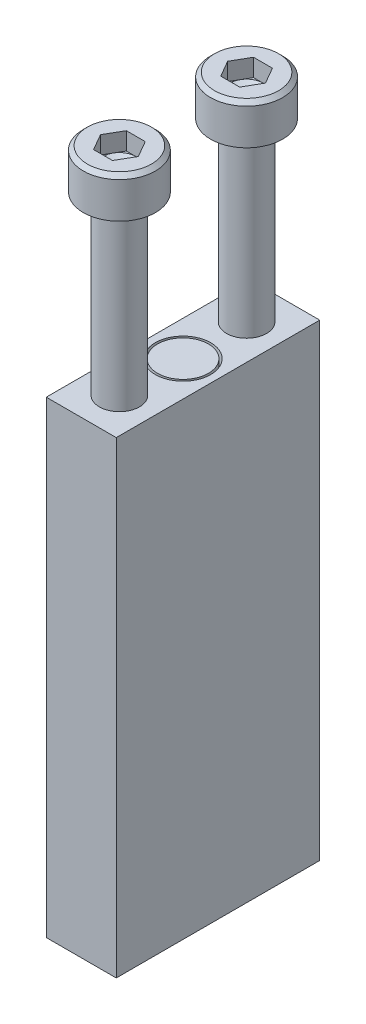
ISO-10303-21;
HEADER;
FILE_DESCRIPTION(('STEP AP214'),'2;1');
FILE_NAME('part.step','',(''),(''),'','','');
FILE_SCHEMA(('AUTOMOTIVE_DESIGN { 1 0 10303 214 1 1 1 1 }'));
ENDSEC;
DATA;
#1=APPLICATION_CONTEXT('core data for automotive mechanical design processes');
#2=APPLICATION_PROTOCOL_DEFINITION('international standard','automotive_design',2000,#1);
#3=PRODUCT_CONTEXT('',#1,'mechanical');
#4=PRODUCT('Part','Part','',(#3));
#5=PRODUCT_RELATED_PRODUCT_CATEGORY('part','',(#4));
#6=PRODUCT_DEFINITION_FORMATION('','',#4);
#7=PRODUCT_DEFINITION_CONTEXT('part definition',#1,'design');
#8=PRODUCT_DEFINITION('design','',#6,#7);
#9=PRODUCT_DEFINITION_SHAPE('','',#8);
#10=(LENGTH_UNIT() NAMED_UNIT(*) SI_UNIT(.MILLI.,.METRE.));
#11=(NAMED_UNIT(*) PLANE_ANGLE_UNIT() SI_UNIT($,.RADIAN.));
#12=(NAMED_UNIT(*) SI_UNIT($,.STERADIAN.) SOLID_ANGLE_UNIT());
#13=UNCERTAINTY_MEASURE_WITH_UNIT(LENGTH_MEASURE(1.E-05),#10,'distance_accuracy_value','');
#14=(GEOMETRIC_REPRESENTATION_CONTEXT(3) GLOBAL_UNCERTAINTY_ASSIGNED_CONTEXT((#13)) GLOBAL_UNIT_ASSIGNED_CONTEXT((#10,
#11,#12)) REPRESENTATION_CONTEXT('',''));
#15=CARTESIAN_POINT('',(0.,0.,0.));
#16=DIRECTION('',(0.,0.,1.));
#17=DIRECTION('',(1.,0.,0.));
#18=AXIS2_PLACEMENT_3D('',#15,#16,#17);
#19=CARTESIAN_POINT('',(-2.1844,0.,0.));
#20=DIRECTION('',(0.,-1.,0.));
#21=DIRECTION('',(1.,0.,0.));
#22=AXIS2_PLACEMENT_3D('',#19,#20,#21);
#23=CYLINDRICAL_SURFACE('',#22,1.5875);
#24=CARTESIAN_POINT('',(-2.1844,0.,0.));
#25=DIRECTION('',(0.,-1.,0.));
#26=DIRECTION('',(1.,0.,0.));
#27=AXIS2_PLACEMENT_3D('',#24,#25,#26);
#28=CIRCLE('',#27,1.5875);
#29=CARTESIAN_POINT('',(-0.5969,0.,0.));
#30=VERTEX_POINT('',#29);
#31=EDGE_CURVE('P0_E9',#30,#30,#28,.T.);
#32=ORIENTED_EDGE('',*,*,#31,.T.);
#33=EDGE_LOOP('',(#32));
#34=FACE_BOUND('',#33,.T.);
#35=CARTESIAN_POINT('',(-2.1844,-19.05,0.));
#36=DIRECTION('',(0.,-1.,0.));
#37=DIRECTION('',(1.,0.,0.));
#38=AXIS2_PLACEMENT_3D('',#35,#36,#37);
#39=CIRCLE('',#38,1.5875);
#40=CARTESIAN_POINT('',(-0.5969,-19.05,0.));
#41=VERTEX_POINT('',#40);
#42=EDGE_CURVE('P0_E19',#41,#41,#39,.T.);
#43=ORIENTED_EDGE('',*,*,#42,.F.);
#44=EDGE_LOOP('',(#43));
#45=FACE_BOUND('',#44,.T.);
#46=ADVANCED_FACE('P0_F13',(#34,#45),#23,.T.);
#47=CARTESIAN_POINT('',(-2.1844,0.,0.));
#48=DIRECTION('',(0.,-1.,0.));
#49=DIRECTION('',(1.,0.,0.));
#50=AXIS2_PLACEMENT_3D('',#47,#48,#49);
#51=PLANE('',#50);
#52=ORIENTED_EDGE('',*,*,#31,.F.);
#53=EDGE_LOOP('',(#52));
#54=FACE_BOUND('',#53,.T.);
#55=ADVANCED_FACE('P0_F28',(#54),#51,.F.);
#56=CARTESIAN_POINT('',(-2.1844,-19.05,0.));
#57=DIRECTION('',(0.,-1.,0.));
#58=DIRECTION('',(1.,0.,0.));
#59=AXIS2_PLACEMENT_3D('',#56,#57,#58);
#60=PLANE('',#59);
#61=ORIENTED_EDGE('',*,*,#42,.T.);
#62=EDGE_LOOP('',(#61));
#63=FACE_BOUND('',#62,.T.);
#64=ADVANCED_FACE('P0_F25',(#63),#60,.T.);
#65=CLOSED_SHELL('',(#46,#55,#64));
#66=MANIFOLD_SOLID_BREP('P0_B1',#65);
#67=CARTESIAN_POINT('',(-4.3688,0.,-6.35));
#68=DIRECTION('',(0.,0.,1.));
#69=DIRECTION('',(0.,1.,0.));
#70=AXIS2_PLACEMENT_3D('',#67,#68,#69);
#71=PLANE('',#70);
#72=DIRECTION('',(0.,-1.,0.));
#73=VECTOR('',#72,1.);
#74=CARTESIAN_POINT('',(0.,0.,-6.35));
#75=LINE('',#74,#73);
#76=CARTESIAN_POINT('',(0.,0.,-6.35));
#77=VERTEX_POINT('',#76);
#78=CARTESIAN_POINT('',(0.,-29.21,-6.35));
#79=VERTEX_POINT('',#78);
#80=EDGE_CURVE('P1_E362',#77,#79,#75,.T.);
#81=ORIENTED_EDGE('',*,*,#80,.T.);
#82=DIRECTION('',(1.,0.,0.));
#83=VECTOR('',#82,1.);
#84=CARTESIAN_POINT('',(-4.3688,-29.21,-6.35));
#85=LINE('',#84,#83);
#86=CARTESIAN_POINT('',(-4.3688,-29.21,-6.35));
#87=VERTEX_POINT('',#86);
#88=EDGE_CURVE('P1_E337',#87,#79,#85,.T.);
#89=ORIENTED_EDGE('',*,*,#88,.F.);
#90=DIRECTION('',(0.,-1.,0.));
#91=VECTOR('',#90,1.);
#92=CARTESIAN_POINT('',(-4.3688,0.,-6.35));
#93=LINE('',#92,#91);
#94=CARTESIAN_POINT('',(-4.3688,0.,-6.35));
#95=VERTEX_POINT('',#94);
#96=EDGE_CURVE('P1_E354',#95,#87,#93,.T.);
#97=ORIENTED_EDGE('',*,*,#96,.F.);
#98=DIRECTION('',(1.,0.,0.));
#99=VECTOR('',#98,1.);
#100=CARTESIAN_POINT('',(-4.3688,0.,-6.35));
#101=LINE('',#100,#99);
#102=EDGE_CURVE('P1_E345',#95,#77,#101,.T.);
#103=ORIENTED_EDGE('',*,*,#102,.T.);
#104=EDGE_LOOP('',(#81,#89,#97,#103));
#105=FACE_BOUND('',#104,.T.);
#106=ADVANCED_FACE('P1_F15',(#105),#71,.F.);
#107=CARTESIAN_POINT('',(-4.3688,-29.21,-6.35));
#108=DIRECTION('',(0.,1.,0.));
#109=DIRECTION('',(-1.,0.,0.));
#110=AXIS2_PLACEMENT_3D('',#107,#108,#109);
#111=PLANE('',#110);
#112=DIRECTION('',(0.,0.,1.));
#113=VECTOR('',#112,1.);
#114=CARTESIAN_POINT('',(0.,-29.21,-6.35));
#115=LINE('',#114,#113);
#116=CARTESIAN_POINT('',(0.,-29.21,6.35));
#117=VERTEX_POINT('',#116);
#118=EDGE_CURVE('P1_E33',#79,#117,#115,.T.);
#119=ORIENTED_EDGE('',*,*,#118,.T.);
#120=DIRECTION('',(1.,0.,0.));
#121=VECTOR('',#120,1.);
#122=CARTESIAN_POINT('',(-4.3688,-29.21,6.35));
#123=LINE('',#122,#121);
#124=CARTESIAN_POINT('',(-4.3688,-29.21,6.35));
#125=VERTEX_POINT('',#124);
#126=EDGE_CURVE('P1_E339',#125,#117,#123,.T.);
#127=ORIENTED_EDGE('',*,*,#126,.F.);
#128=DIRECTION('',(0.,0.,1.));
#129=VECTOR('',#128,1.);
#130=CARTESIAN_POINT('',(-4.3688,-29.21,-6.35));
#131=LINE('',#130,#129);
#132=EDGE_CURVE('P1_E352',#87,#125,#131,.T.);
#133=ORIENTED_EDGE('',*,*,#132,.F.);
#134=ORIENTED_EDGE('',*,*,#88,.T.);
#135=EDGE_LOOP('',(#119,#127,#133,#134));
#136=FACE_BOUND('',#135,.T.);
#137=ADVANCED_FACE('P1_F494',(#136),#111,.F.);
#138=CARTESIAN_POINT('',(-4.3688,0.,6.35));
#139=DIRECTION('',(0.,0.,-1.));
#140=DIRECTION('',(0.,-1.,0.));
#141=AXIS2_PLACEMENT_3D('',#138,#139,#140);
#142=PLANE('',#141);
#143=DIRECTION('',(0.,1.,0.));
#144=VECTOR('',#143,1.);
#145=CARTESIAN_POINT('',(0.,0.,6.35));
#146=LINE('',#145,#144);
#147=CARTESIAN_POINT('',(0.,0.,6.35));
#148=VERTEX_POINT('',#147);
#149=EDGE_CURVE('P1_E359',#117,#148,#146,.T.);
#150=ORIENTED_EDGE('',*,*,#149,.T.);
#151=DIRECTION('',(1.,0.,0.));
#152=VECTOR('',#151,1.);
#153=CARTESIAN_POINT('',(-4.3688,0.,6.35));
#154=LINE('',#153,#152);
#155=CARTESIAN_POINT('',(-4.3688,0.,6.35));
#156=VERTEX_POINT('',#155);
#157=EDGE_CURVE('P1_E342',#156,#148,#154,.T.);
#158=ORIENTED_EDGE('',*,*,#157,.F.);
#159=DIRECTION('',(0.,1.,0.));
#160=VECTOR('',#159,1.);
#161=CARTESIAN_POINT('',(-4.3688,0.,6.35));
#162=LINE('',#161,#160);
#163=EDGE_CURVE('P1_E350',#125,#156,#162,.T.);
#164=ORIENTED_EDGE('',*,*,#163,.F.);
#165=ORIENTED_EDGE('',*,*,#126,.T.);
#166=EDGE_LOOP('',(#150,#158,#164,#165));
#167=FACE_BOUND('',#166,.T.);
#168=ADVANCED_FACE('P1_F373',(#167),#142,.F.);
#169=CARTESIAN_POINT('',(-4.3688,0.,-6.35));
#170=DIRECTION('',(0.,-1.,0.));
#171=DIRECTION('',(1.,0.,0.));
#172=AXIS2_PLACEMENT_3D('',#169,#170,#171);
#173=PLANE('',#172);
#174=CARTESIAN_POINT('',(-2.1844,0.,-3.96875));
#175=DIRECTION('',(0.,-1.,0.));
#176=DIRECTION('',(0.,0.,-1.));
#177=AXIS2_PLACEMENT_3D('',#174,#175,#176);
#178=CIRCLE('',#177,1.25);
#179=CARTESIAN_POINT('',(-2.1844,0.,-5.21875));
#180=VERTEX_POINT('',#179);
#181=EDGE_CURVE('P1_E919',#180,#180,#178,.F.);
#182=ORIENTED_EDGE('',*,*,#181,.F.);
#183=EDGE_LOOP('',(#182));
#184=FACE_BOUND('',#183,.T.);
#185=CARTESIAN_POINT('',(-2.1844,0.,3.96875));
#186=DIRECTION('',(0.,-1.,0.));
#187=DIRECTION('',(0.,0.,-1.));
#188=AXIS2_PLACEMENT_3D('',#185,#186,#187);
#189=CIRCLE('',#188,1.25);
#190=CARTESIAN_POINT('',(-2.1844,0.,2.71875));
#191=VERTEX_POINT('',#190);
#192=EDGE_CURVE('P1_E257',#191,#191,#189,.F.);
#193=ORIENTED_EDGE('',*,*,#192,.F.);
#194=EDGE_LOOP('',(#193));
#195=FACE_BOUND('',#194,.T.);
#196=CARTESIAN_POINT('',(-2.1844,0.,0.));
#197=DIRECTION('',(0.,1.,0.));
#198=DIRECTION('',(-1.,0.,0.));
#199=AXIS2_PLACEMENT_3D('',#196,#197,#198);
#200=CIRCLE('',#199,1.7272);
#201=CARTESIAN_POINT('',(-3.9116,0.,0.));
#202=VERTEX_POINT('',#201);
#203=EDGE_CURVE('P1_E23',#202,#202,#200,.T.);
#204=ORIENTED_EDGE('',*,*,#203,.F.);
#205=EDGE_LOOP('',(#204));
#206=FACE_BOUND('',#205,.T.);
#207=DIRECTION('',(0.,0.,-1.));
#208=VECTOR('',#207,1.);
#209=CARTESIAN_POINT('',(0.,0.,-6.35));
#210=LINE('',#209,#208);
#211=EDGE_CURVE('P1_E357',#148,#77,#210,.T.);
#212=ORIENTED_EDGE('',*,*,#211,.T.);
#213=ORIENTED_EDGE('',*,*,#102,.F.);
#214=DIRECTION('',(0.,0.,-1.));
#215=VECTOR('',#214,1.);
#216=CARTESIAN_POINT('',(-4.3688,0.,-6.35));
#217=LINE('',#216,#215);
#218=EDGE_CURVE('P1_E348',#156,#95,#217,.T.);
#219=ORIENTED_EDGE('',*,*,#218,.F.);
#220=ORIENTED_EDGE('',*,*,#157,.T.);
#221=EDGE_LOOP('',(#212,#213,#219,#220));
#222=FACE_BOUND('',#221,.T.);
#223=ADVANCED_FACE('P1_F369',(#184,#195,#206,#222),#173,.F.);
#224=CARTESIAN_POINT('',(-4.3688,-29.21,-6.35));
#225=DIRECTION('',(-1.,0.,0.));
#226=DIRECTION('',(0.,0.,1.));
#227=AXIS2_PLACEMENT_3D('',#224,#225,#226);
#228=PLANE('',#227);
#229=ORIENTED_EDGE('',*,*,#96,.T.);
#230=ORIENTED_EDGE('',*,*,#132,.T.);
#231=ORIENTED_EDGE('',*,*,#163,.T.);
#232=ORIENTED_EDGE('',*,*,#218,.T.);
#233=EDGE_LOOP('',(#229,#230,#231,#232));
#234=FACE_BOUND('',#233,.T.);
#235=ADVANCED_FACE('P1_F372',(#234),#228,.T.);
#236=CARTESIAN_POINT('',(0.,-29.21,-6.35));
#237=DIRECTION('',(-1.,0.,0.));
#238=DIRECTION('',(0.,0.,1.));
#239=AXIS2_PLACEMENT_3D('',#236,#237,#238);
#240=PLANE('',#239);
#241=ORIENTED_EDGE('',*,*,#80,.F.);
#242=ORIENTED_EDGE('',*,*,#211,.F.);
#243=ORIENTED_EDGE('',*,*,#149,.F.);
#244=ORIENTED_EDGE('',*,*,#118,.F.);
#245=EDGE_LOOP('',(#241,#242,#243,#244));
#246=FACE_BOUND('',#245,.T.);
#247=ADVANCED_FACE('P1_F383',(#246),#240,.F.);
#248=CARTESIAN_POINT('',(-2.1844,0.,0.));
#249=DIRECTION('',(0.,1.,0.));
#250=DIRECTION('',(-1.,0.,0.));
#251=AXIS2_PLACEMENT_3D('',#248,#249,#250);
#252=CYLINDRICAL_SURFACE('',#251,1.7272);
#253=CARTESIAN_POINT('',(-2.1844,-26.67,0.));
#254=DIRECTION('',(0.,1.,0.));
#255=DIRECTION('',(-1.,0.,0.));
#256=AXIS2_PLACEMENT_3D('',#253,#254,#255);
#257=CIRCLE('',#256,1.7272);
#258=CARTESIAN_POINT('',(-3.9116,-26.67,0.));
#259=VERTEX_POINT('',#258);
#260=EDGE_CURVE('P1_E10',#259,#259,#257,.T.);
#261=ORIENTED_EDGE('',*,*,#260,.F.);
#262=EDGE_LOOP('',(#261));
#263=FACE_BOUND('',#262,.T.);
#264=ORIENTED_EDGE('',*,*,#203,.T.);
#265=EDGE_LOOP('',(#264));
#266=FACE_BOUND('',#265,.T.);
#267=ADVANCED_FACE('P1_F367',(#263,#266),#252,.F.);
#268=CARTESIAN_POINT('',(-2.1844,-26.67,0.));
#269=DIRECTION('',(0.,1.,0.));
#270=DIRECTION('',(-1.,0.,0.));
#271=AXIS2_PLACEMENT_3D('',#268,#269,#270);
#272=CONICAL_SURFACE('',#271,1.7272,1.02974425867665);
#273=CARTESIAN_POINT('',(-2.1844,-27.7078064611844,0.));
#274=VERTEX_POINT('',#273);
#275=VERTEX_LOOP('',#274);
#276=FACE_BOUND('',#275,.T.);
#277=ORIENTED_EDGE('',*,*,#260,.T.);
#278=EDGE_LOOP('',(#277));
#279=FACE_BOUND('',#278,.T.);
#280=ADVANCED_FACE('P1_F17',(#276,#279),#272,.F.);
#281=CARTESIAN_POINT('',(-2.1844,12.4,3.96875));
#282=DIRECTION('',(0.,1.,0.));
#283=DIRECTION('',(0.,0.,1.));
#284=AXIS2_PLACEMENT_3D('',#281,#282,#283);
#285=CONICAL_SURFACE('',#284,1.0225,1.04719755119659);
#286=CARTESIAN_POINT('',(-2.1844,11.8096593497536,3.96875));
#287=VERTEX_POINT('',#286);
#288=VERTEX_LOOP('',#287);
#289=FACE_BOUND('',#288,.T.);
#290=CARTESIAN_POINT('',(-2.1844,12.4,3.96875));
#291=DIRECTION('',(0.,1.,0.));
#292=DIRECTION('',(0.,0.,1.));
#293=AXIS2_PLACEMENT_3D('',#290,#291,#292);
#294=CIRCLE('',#293,1.0225);
#295=CARTESIAN_POINT('',(-2.1844,12.4,4.99125));
#296=VERTEX_POINT('',#295);
#297=CARTESIAN_POINT('',(-1.29888902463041,12.4,4.48));
#298=VERTEX_POINT('',#297);
#299=EDGE_CURVE('P1_E275',#296,#298,#294,.T.);
#300=ORIENTED_EDGE('',*,*,#299,.T.);
#301=CARTESIAN_POINT('',(-1.29888902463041,12.4,3.4575));
#302=VERTEX_POINT('',#301);
#303=EDGE_CURVE('P1_E278',#298,#302,#294,.T.);
#304=ORIENTED_EDGE('',*,*,#303,.T.);
#305=CARTESIAN_POINT('',(-2.1844,12.4,2.94625));
#306=VERTEX_POINT('',#305);
#307=EDGE_CURVE('P1_E967',#302,#306,#294,.T.);
#308=ORIENTED_EDGE('',*,*,#307,.T.);
#309=CARTESIAN_POINT('',(-3.06991097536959,12.4,3.4575));
#310=VERTEX_POINT('',#309);
#311=EDGE_CURVE('P1_E980',#306,#310,#294,.T.);
#312=ORIENTED_EDGE('',*,*,#311,.T.);
#313=CARTESIAN_POINT('',(-3.06991097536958,12.4,4.48));
#314=VERTEX_POINT('',#313);
#315=EDGE_CURVE('P1_E979',#310,#314,#294,.T.);
#316=ORIENTED_EDGE('',*,*,#315,.T.);
#317=EDGE_CURVE('P1_E279',#314,#296,#294,.T.);
#318=ORIENTED_EDGE('',*,*,#317,.T.);
#319=EDGE_LOOP('',(#300,#304,#308,#312,#316,#318));
#320=FACE_BOUND('',#319,.T.);
#321=ADVANCED_FACE('P1_F456',(#289,#320),#285,.F.);
#322=CARTESIAN_POINT('',(-1.59405934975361,12.4,4.99125));
#323=DIRECTION('',(0.,1.,0.));
#324=DIRECTION('',(0.,0.,1.));
#325=AXIS2_PLACEMENT_3D('',#322,#323,#324);
#326=PLANE('',#325);
#327=ORIENTED_EDGE('',*,*,#307,.F.);
#328=DIRECTION('',(-0.5,0.,-0.866025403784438));
#329=VECTOR('',#328,1.);
#330=CARTESIAN_POINT('',(-1.00371869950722,12.4,3.96875));
#331=LINE('',#330,#329);
#332=CARTESIAN_POINT('',(-1.59405934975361,12.4,2.94625));
#333=VERTEX_POINT('',#332);
#334=EDGE_CURVE('P1_E301',#302,#333,#331,.T.);
#335=ORIENTED_EDGE('',*,*,#334,.T.);
#336=DIRECTION('',(-1.,0.,0.));
#337=VECTOR('',#336,1.);
#338=CARTESIAN_POINT('',(-1.59405934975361,12.4,2.94625));
#339=LINE('',#338,#337);
#340=EDGE_CURVE('P1_E302',#333,#306,#339,.T.);
#341=ORIENTED_EDGE('',*,*,#340,.T.);
#342=EDGE_LOOP('',(#327,#335,#341));
#343=FACE_BOUND('',#342,.T.);
#344=ADVANCED_FACE('P1_F459',(#343),#326,.T.);
#345=ORIENTED_EDGE('',*,*,#311,.F.);
#346=CARTESIAN_POINT('',(-2.77474065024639,12.4,2.94625));
#347=VERTEX_POINT('',#346);
#348=EDGE_CURVE('P1_E305',#306,#347,#339,.T.);
#349=ORIENTED_EDGE('',*,*,#348,.T.);
#350=DIRECTION('',(0.5,0.,-0.866025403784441));
#351=VECTOR('',#350,1.);
#352=CARTESIAN_POINT('',(-3.36508130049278,12.4,3.96875));
#353=LINE('',#352,#351);
#354=EDGE_CURVE('P1_E309',#310,#347,#353,.T.);
#355=ORIENTED_EDGE('',*,*,#354,.F.);
#356=EDGE_LOOP('',(#345,#349,#355));
#357=FACE_BOUND('',#356,.T.);
#358=ADVANCED_FACE('P1_F556',(#357),#326,.T.);
#359=ORIENTED_EDGE('',*,*,#315,.F.);
#360=CARTESIAN_POINT('',(-3.36508130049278,12.4,3.96875));
#361=VERTEX_POINT('',#360);
#362=EDGE_CURVE('P1_E306',#361,#310,#353,.T.);
#363=ORIENTED_EDGE('',*,*,#362,.F.);
#364=DIRECTION('',(-0.5,0.,-0.866025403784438));
#365=VECTOR('',#364,1.);
#366=CARTESIAN_POINT('',(-2.77474065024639,12.4,4.99125));
#367=LINE('',#366,#365);
#368=EDGE_CURVE('P1_E313',#314,#361,#367,.T.);
#369=ORIENTED_EDGE('',*,*,#368,.F.);
#370=EDGE_LOOP('',(#359,#363,#369));
#371=FACE_BOUND('',#370,.T.);
#372=ADVANCED_FACE('P1_F490',(#371),#326,.T.);
#373=ORIENTED_EDGE('',*,*,#317,.F.);
#374=CARTESIAN_POINT('',(-2.77474065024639,12.4,4.99125));
#375=VERTEX_POINT('',#374);
#376=EDGE_CURVE('P1_E310',#375,#314,#367,.T.);
#377=ORIENTED_EDGE('',*,*,#376,.F.);
#378=DIRECTION('',(1.,0.,0.));
#379=VECTOR('',#378,1.);
#380=CARTESIAN_POINT('',(-2.77474065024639,12.4,4.99125));
#381=LINE('',#380,#379);
#382=EDGE_CURVE('P1_E314',#375,#296,#381,.T.);
#383=ORIENTED_EDGE('',*,*,#382,.T.);
#384=EDGE_LOOP('',(#373,#377,#383));
#385=FACE_BOUND('',#384,.T.);
#386=ADVANCED_FACE('P1_F486',(#385),#326,.T.);
#387=ORIENTED_EDGE('',*,*,#299,.F.);
#388=CARTESIAN_POINT('',(-1.59405934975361,12.4,4.99125));
#389=VERTEX_POINT('',#388);
#390=EDGE_CURVE('P1_E317',#296,#389,#381,.T.);
#391=ORIENTED_EDGE('',*,*,#390,.T.);
#392=DIRECTION('',(-0.5,0.,0.866025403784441));
#393=VECTOR('',#392,1.);
#394=CARTESIAN_POINT('',(-1.00371869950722,12.4,3.96875));
#395=LINE('',#394,#393);
#396=EDGE_CURVE('P1_E320',#298,#389,#395,.T.);
#397=ORIENTED_EDGE('',*,*,#396,.F.);
#398=EDGE_LOOP('',(#387,#391,#397));
#399=FACE_BOUND('',#398,.T.);
#400=ADVANCED_FACE('P1_F489',(#399),#326,.T.);
#401=ORIENTED_EDGE('',*,*,#303,.F.);
#402=CARTESIAN_POINT('',(-1.00371869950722,12.4,3.96875));
#403=VERTEX_POINT('',#402);
#404=EDGE_CURVE('P1_E318',#403,#298,#395,.T.);
#405=ORIENTED_EDGE('',*,*,#404,.F.);
#406=EDGE_CURVE('P1_E298',#403,#302,#331,.T.);
#407=ORIENTED_EDGE('',*,*,#406,.T.);
#408=EDGE_LOOP('',(#401,#405,#407));
#409=FACE_BOUND('',#408,.T.);
#410=ADVANCED_FACE('P1_F484',(#409),#326,.T.);
#411=CARTESIAN_POINT('',(-1.00371869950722,12.4,3.96875));
#412=DIRECTION('',(0.866025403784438,0.,-0.5));
#413=DIRECTION('',(0.5,0.,0.866025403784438));
#414=AXIS2_PLACEMENT_3D('',#411,#412,#413);
#415=PLANE('',#414);
#416=DIRECTION('',(-0.5,0.,-0.866025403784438));
#417=VECTOR('',#416,1.);
#418=CARTESIAN_POINT('',(-1.00371869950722,13.5,3.96875));
#419=LINE('',#418,#417);
#420=CARTESIAN_POINT('',(-1.00371869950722,13.5,3.96875));
#421=VERTEX_POINT('',#420);
#422=CARTESIAN_POINT('',(-1.59405934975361,13.5,2.94625));
#423=VERTEX_POINT('',#422);
#424=EDGE_CURVE('P1_E321',#421,#423,#419,.T.);
#425=ORIENTED_EDGE('',*,*,#424,.T.);
#426=DIRECTION('',(0.,1.,0.));
#427=VECTOR('',#426,1.);
#428=CARTESIAN_POINT('',(-1.59405934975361,12.4,2.94625));
#429=LINE('',#428,#427);
#430=EDGE_CURVE('P1_E292',#333,#423,#429,.T.);
#431=ORIENTED_EDGE('',*,*,#430,.F.);
#432=ORIENTED_EDGE('',*,*,#334,.F.);
#433=ORIENTED_EDGE('',*,*,#406,.F.);
#434=DIRECTION('',(0.,1.,0.));
#435=VECTOR('',#434,1.);
#436=CARTESIAN_POINT('',(-1.00371869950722,12.4,3.96875));
#437=LINE('',#436,#435);
#438=EDGE_CURVE('P1_E295',#403,#421,#437,.T.);
#439=ORIENTED_EDGE('',*,*,#438,.T.);
#440=EDGE_LOOP('',(#425,#431,#432,#433,#439));
#441=FACE_BOUND('',#440,.T.);
#442=ADVANCED_FACE('P1_F480',(#441),#415,.F.);
#443=CARTESIAN_POINT('',(-1.59405934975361,12.4,2.94625));
#444=DIRECTION('',(0.,0.,-1.));
#445=DIRECTION('',(1.,0.,0.));
#446=AXIS2_PLACEMENT_3D('',#443,#444,#445);
#447=PLANE('',#446);
#448=DIRECTION('',(-1.,0.,0.));
#449=VECTOR('',#448,1.);
#450=CARTESIAN_POINT('',(-1.59405934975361,13.5,2.94625));
#451=LINE('',#450,#449);
#452=CARTESIAN_POINT('',(-2.77474065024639,13.5,2.94625));
#453=VERTEX_POINT('',#452);
#454=EDGE_CURVE('P1_E324',#423,#453,#451,.T.);
#455=ORIENTED_EDGE('',*,*,#454,.T.);
#456=DIRECTION('',(0.,1.,0.));
#457=VECTOR('',#456,1.);
#458=CARTESIAN_POINT('',(-2.77474065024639,12.4,2.94625));
#459=LINE('',#458,#457);
#460=EDGE_CURVE('P1_E289',#347,#453,#459,.T.);
#461=ORIENTED_EDGE('',*,*,#460,.F.);
#462=ORIENTED_EDGE('',*,*,#348,.F.);
#463=ORIENTED_EDGE('',*,*,#340,.F.);
#464=ORIENTED_EDGE('',*,*,#430,.T.);
#465=EDGE_LOOP('',(#455,#461,#462,#463,#464));
#466=FACE_BOUND('',#465,.T.);
#467=ADVANCED_FACE('P1_F476',(#466),#447,.F.);
#468=CARTESIAN_POINT('',(-3.36508130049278,12.4,3.96875));
#469=DIRECTION('',(0.866025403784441,0.,0.5));
#470=DIRECTION('',(-0.5,0.,0.866025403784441));
#471=AXIS2_PLACEMENT_3D('',#468,#469,#470);
#472=PLANE('',#471);
#473=DIRECTION('',(0.5,0.,-0.866025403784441));
#474=VECTOR('',#473,1.);
#475=CARTESIAN_POINT('',(-3.36508130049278,13.5,3.96875));
#476=LINE('',#475,#474);
#477=CARTESIAN_POINT('',(-3.36508130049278,13.5,3.96875));
#478=VERTEX_POINT('',#477);
#479=EDGE_CURVE('P1_E326',#478,#453,#476,.T.);
#480=ORIENTED_EDGE('',*,*,#479,.F.);
#481=DIRECTION('',(0.,1.,0.));
#482=VECTOR('',#481,1.);
#483=CARTESIAN_POINT('',(-3.36508130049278,12.4,3.96875));
#484=LINE('',#483,#482);
#485=EDGE_CURVE('P1_E286',#361,#478,#484,.T.);
#486=ORIENTED_EDGE('',*,*,#485,.F.);
#487=ORIENTED_EDGE('',*,*,#362,.T.);
#488=ORIENTED_EDGE('',*,*,#354,.T.);
#489=ORIENTED_EDGE('',*,*,#460,.T.);
#490=EDGE_LOOP('',(#480,#486,#487,#488,#489));
#491=FACE_BOUND('',#490,.T.);
#492=ADVANCED_FACE('P1_F472',(#491),#472,.T.);
#493=CARTESIAN_POINT('',(-2.77474065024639,12.4,4.99125));
#494=DIRECTION('',(0.866025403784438,0.,-0.5));
#495=DIRECTION('',(0.5,0.,0.866025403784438));
#496=AXIS2_PLACEMENT_3D('',#493,#494,#495);
#497=PLANE('',#496);
#498=DIRECTION('',(-0.5,0.,-0.866025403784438));
#499=VECTOR('',#498,1.);
#500=CARTESIAN_POINT('',(-2.77474065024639,13.5,4.99125));
#501=LINE('',#500,#499);
#502=CARTESIAN_POINT('',(-2.77474065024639,13.5,4.99125));
#503=VERTEX_POINT('',#502);
#504=EDGE_CURVE('P1_E329',#503,#478,#501,.T.);
#505=ORIENTED_EDGE('',*,*,#504,.F.);
#506=DIRECTION('',(0.,1.,0.));
#507=VECTOR('',#506,1.);
#508=CARTESIAN_POINT('',(-2.77474065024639,12.4,4.99125));
#509=LINE('',#508,#507);
#510=EDGE_CURVE('P1_E283',#375,#503,#509,.T.);
#511=ORIENTED_EDGE('',*,*,#510,.F.);
#512=ORIENTED_EDGE('',*,*,#376,.T.);
#513=ORIENTED_EDGE('',*,*,#368,.T.);
#514=ORIENTED_EDGE('',*,*,#485,.T.);
#515=EDGE_LOOP('',(#505,#511,#512,#513,#514));
#516=FACE_BOUND('',#515,.T.);
#517=ADVANCED_FACE('P1_F468',(#516),#497,.T.);
#518=CARTESIAN_POINT('',(-2.77474065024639,12.4,4.99125));
#519=DIRECTION('',(0.,0.,1.));
#520=DIRECTION('',(-1.,0.,0.));
#521=AXIS2_PLACEMENT_3D('',#518,#519,#520);
#522=PLANE('',#521);
#523=DIRECTION('',(1.,0.,0.));
#524=VECTOR('',#523,1.);
#525=CARTESIAN_POINT('',(-2.77474065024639,13.5,4.99125));
#526=LINE('',#525,#524);
#527=CARTESIAN_POINT('',(-1.59405934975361,13.5,4.99125));
#528=VERTEX_POINT('',#527);
#529=EDGE_CURVE('P1_E332',#503,#528,#526,.T.);
#530=ORIENTED_EDGE('',*,*,#529,.T.);
#531=DIRECTION('',(0.,1.,0.));
#532=VECTOR('',#531,1.);
#533=CARTESIAN_POINT('',(-1.59405934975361,12.4,4.99125));
#534=LINE('',#533,#532);
#535=EDGE_CURVE('P1_E280',#389,#528,#534,.T.);
#536=ORIENTED_EDGE('',*,*,#535,.F.);
#537=ORIENTED_EDGE('',*,*,#390,.F.);
#538=ORIENTED_EDGE('',*,*,#382,.F.);
#539=ORIENTED_EDGE('',*,*,#510,.T.);
#540=EDGE_LOOP('',(#530,#536,#537,#538,#539));
#541=FACE_BOUND('',#540,.T.);
#542=ADVANCED_FACE('P1_F464',(#541),#522,.F.);
#543=CARTESIAN_POINT('',(-1.00371869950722,12.4,3.96875));
#544=DIRECTION('',(-0.86602540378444,0.,-0.5));
#545=DIRECTION('',(0.5,0.,-0.866025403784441));
#546=AXIS2_PLACEMENT_3D('',#543,#544,#545);
#547=PLANE('',#546);
#548=DIRECTION('',(-0.5,0.,0.866025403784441));
#549=VECTOR('',#548,1.);
#550=CARTESIAN_POINT('',(-1.00371869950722,13.5,3.96875));
#551=LINE('',#550,#549);
#552=EDGE_CURVE('P1_E334',#421,#528,#551,.T.);
#553=ORIENTED_EDGE('',*,*,#552,.F.);
#554=ORIENTED_EDGE('',*,*,#438,.F.);
#555=ORIENTED_EDGE('',*,*,#404,.T.);
#556=ORIENTED_EDGE('',*,*,#396,.T.);
#557=ORIENTED_EDGE('',*,*,#535,.T.);
#558=EDGE_LOOP('',(#553,#554,#555,#556,#557));
#559=FACE_BOUND('',#558,.T.);
#560=ADVANCED_FACE('P1_F440',(#559),#547,.T.);
#561=CARTESIAN_POINT('',(-2.1844,13.5,3.96875));
#562=DIRECTION('',(0.,1.,0.));
#563=DIRECTION('',(0.,0.,1.));
#564=AXIS2_PLACEMENT_3D('',#561,#562,#563);
#565=PLANE('',#564);
#566=ORIENTED_EDGE('',*,*,#552,.T.);
#567=ORIENTED_EDGE('',*,*,#529,.F.);
#568=ORIENTED_EDGE('',*,*,#504,.T.);
#569=ORIENTED_EDGE('',*,*,#479,.T.);
#570=ORIENTED_EDGE('',*,*,#454,.F.);
#571=ORIENTED_EDGE('',*,*,#424,.F.);
#572=EDGE_LOOP('',(#566,#567,#568,#569,#570,#571));
#573=FACE_BOUND('',#572,.T.);
#574=CARTESIAN_POINT('',(-2.1844,13.5,3.96875));
#575=DIRECTION('',(0.,1.,0.));
#576=DIRECTION('',(0.,0.,1.));
#577=AXIS2_PLACEMENT_3D('',#574,#575,#576);
#578=CIRCLE('',#577,2.);
#579=CARTESIAN_POINT('',(-2.1844,13.5,5.96875));
#580=VERTEX_POINT('',#579);
#581=EDGE_CURVE('P1_E266',#580,#580,#578,.T.);
#582=ORIENTED_EDGE('',*,*,#581,.T.);
#583=EDGE_LOOP('',(#582));
#584=FACE_BOUND('',#583,.T.);
#585=ADVANCED_FACE('P1_F436',(#573,#584),#565,.T.);
#586=CARTESIAN_POINT('',(-2.1844,13.5,3.96875));
#587=DIRECTION('',(0.,-1.,0.));
#588=DIRECTION('',(0.,0.,-1.));
#589=AXIS2_PLACEMENT_3D('',#586,#587,#588);
#590=CONICAL_SURFACE('',#589,2.,0.785398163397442);
#591=CARTESIAN_POINT('',(-2.1844,13.25,3.96875));
#592=DIRECTION('',(0.,1.,0.));
#593=DIRECTION('',(0.,0.,1.));
#594=AXIS2_PLACEMENT_3D('',#591,#592,#593);
#595=CIRCLE('',#594,2.25);
#596=CARTESIAN_POINT('',(-2.1844,13.25,6.21875));
#597=VERTEX_POINT('',#596);
#598=EDGE_CURVE('P1_E269',#597,#597,#595,.T.);
#599=ORIENTED_EDGE('',*,*,#598,.T.);
#600=EDGE_LOOP('',(#599));
#601=FACE_BOUND('',#600,.T.);
#602=ORIENTED_EDGE('',*,*,#581,.F.);
#603=EDGE_LOOP('',(#602));
#604=FACE_BOUND('',#603,.T.);
#605=ADVANCED_FACE('P1_F439',(#601,#604),#590,.T.);
#606=CARTESIAN_POINT('',(-2.1844,45.25,3.96875));
#607=DIRECTION('',(0.,1.,0.));
#608=DIRECTION('',(0.,0.,1.));
#609=AXIS2_PLACEMENT_3D('',#606,#607,#608);
#610=CYLINDRICAL_SURFACE('',#609,2.25);
#611=CARTESIAN_POINT('',(-2.1844,11.,3.96875));
#612=DIRECTION('',(0.,1.,0.));
#613=DIRECTION('',(0.,0.,1.));
#614=AXIS2_PLACEMENT_3D('',#611,#612,#613);
#615=CIRCLE('',#614,2.25);
#616=CARTESIAN_POINT('',(-2.1844,11.,6.21875));
#617=VERTEX_POINT('',#616);
#618=EDGE_CURVE('P1_E272',#617,#617,#615,.T.);
#619=ORIENTED_EDGE('',*,*,#618,.T.);
#620=EDGE_LOOP('',(#619));
#621=FACE_BOUND('',#620,.T.);
#622=ORIENTED_EDGE('',*,*,#598,.F.);
#623=EDGE_LOOP('',(#622));
#624=FACE_BOUND('',#623,.T.);
#625=ADVANCED_FACE('P1_F444',(#621,#624),#610,.T.);
#626=CARTESIAN_POINT('',(0.0656,11.,3.96875));
#627=DIRECTION('',(0.,-1.,0.));
#628=DIRECTION('',(0.,0.,-1.));
#629=AXIS2_PLACEMENT_3D('',#626,#627,#628);
#630=PLANE('',#629);
#631=CARTESIAN_POINT('',(-2.1844,11.,3.96875));
#632=DIRECTION('',(0.,-1.,0.));
#633=DIRECTION('',(0.,0.,-1.));
#634=AXIS2_PLACEMENT_3D('',#631,#632,#633);
#635=CIRCLE('',#634,1.35);
#636=CARTESIAN_POINT('',(-2.1844,11.,2.61875));
#637=VERTEX_POINT('',#636);
#638=EDGE_CURVE('P1_E263',#637,#637,#635,.F.);
#639=ORIENTED_EDGE('',*,*,#638,.T.);
#640=EDGE_LOOP('',(#639));
#641=FACE_BOUND('',#640,.T.);
#642=ORIENTED_EDGE('',*,*,#618,.F.);
#643=EDGE_LOOP('',(#642));
#644=FACE_BOUND('',#643,.T.);
#645=ADVANCED_FACE('P1_F448',(#641,#644),#630,.T.);
#646=CARTESIAN_POINT('',(-2.1844,10.9,3.96875));
#647=DIRECTION('',(0.,-1.,0.));
#648=DIRECTION('',(0.,0.,-1.));
#649=AXIS2_PLACEMENT_3D('',#646,#647,#648);
#650=TOROIDAL_SURFACE('',#649,1.35,0.1);
#651=CARTESIAN_POINT('',(-2.1844,10.9,3.96875));
#652=DIRECTION('',(0.,-1.,0.));
#653=DIRECTION('',(0.,0.,-1.));
#654=AXIS2_PLACEMENT_3D('',#651,#652,#653);
#655=CIRCLE('',#654,1.25);
#656=CARTESIAN_POINT('',(-2.1844,10.9,2.71875));
#657=VERTEX_POINT('',#656);
#658=EDGE_CURVE('P1_E260',#657,#657,#655,.T.);
#659=ORIENTED_EDGE('',*,*,#658,.F.);
#660=EDGE_LOOP('',(#659));
#661=FACE_BOUND('',#660,.T.);
#662=ORIENTED_EDGE('',*,*,#638,.F.);
#663=EDGE_LOOP('',(#662));
#664=FACE_BOUND('',#663,.T.);
#665=ADVANCED_FACE('P1_F404',(#661,#664),#650,.F.);
#666=CARTESIAN_POINT('',(-2.1844,45.25,3.96875));
#667=DIRECTION('',(0.,1.,0.));
#668=DIRECTION('',(0.,0.,1.));
#669=AXIS2_PLACEMENT_3D('',#666,#667,#668);
#670=CYLINDRICAL_SURFACE('',#669,1.25);
#671=ORIENTED_EDGE('',*,*,#658,.T.);
#672=EDGE_LOOP('',(#671));
#673=FACE_BOUND('',#672,.T.);
#674=ORIENTED_EDGE('',*,*,#192,.T.);
#675=EDGE_LOOP('',(#674));
#676=FACE_BOUND('',#675,.T.);
#677=ADVANCED_FACE('P1_F395',(#673,#676),#670,.T.);
#678=CARTESIAN_POINT('',(-2.1844,12.4,-3.96875));
#679=DIRECTION('',(0.,1.,0.));
#680=DIRECTION('',(0.,0.,1.));
#681=AXIS2_PLACEMENT_3D('',#678,#679,#680);
#682=CONICAL_SURFACE('',#681,1.0225,1.04719755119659);
#683=CARTESIAN_POINT('',(-2.1844,11.8096593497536,-3.96875));
#684=VERTEX_POINT('',#683);
#685=VERTEX_LOOP('',#684);
#686=FACE_BOUND('',#685,.T.);
#687=CARTESIAN_POINT('',(-2.1844,12.4,-3.96875));
#688=DIRECTION('',(0.,1.,0.));
#689=DIRECTION('',(0.,0.,1.));
#690=AXIS2_PLACEMENT_3D('',#687,#688,#689);
#691=CIRCLE('',#690,1.0225);
#692=CARTESIAN_POINT('',(-2.1844,12.4,-2.94625));
#693=VERTEX_POINT('',#692);
#694=CARTESIAN_POINT('',(-1.29888902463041,12.4,-3.4575));
#695=VERTEX_POINT('',#694);
#696=EDGE_CURVE('P1_E188',#693,#695,#691,.T.);
#697=ORIENTED_EDGE('',*,*,#696,.T.);
#698=CARTESIAN_POINT('',(-1.29888902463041,12.4,-4.48));
#699=VERTEX_POINT('',#698);
#700=EDGE_CURVE('P1_E192',#695,#699,#691,.T.);
#701=ORIENTED_EDGE('',*,*,#700,.T.);
#702=CARTESIAN_POINT('',(-2.1844,12.4,-4.99125));
#703=VERTEX_POINT('',#702);
#704=EDGE_CURVE('P1_E197',#699,#703,#691,.T.);
#705=ORIENTED_EDGE('',*,*,#704,.T.);
#706=CARTESIAN_POINT('',(-3.06991097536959,12.4,-4.48));
#707=VERTEX_POINT('',#706);
#708=EDGE_CURVE('P1_E211',#703,#707,#691,.T.);
#709=ORIENTED_EDGE('',*,*,#708,.T.);
#710=CARTESIAN_POINT('',(-3.06991097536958,12.4,-3.4575));
#711=VERTEX_POINT('',#710);
#712=EDGE_CURVE('P1_E209',#707,#711,#691,.T.);
#713=ORIENTED_EDGE('',*,*,#712,.T.);
#714=EDGE_CURVE('P1_E202',#711,#693,#691,.T.);
#715=ORIENTED_EDGE('',*,*,#714,.T.);
#716=EDGE_LOOP('',(#697,#701,#705,#709,#713,#715));
#717=FACE_BOUND('',#716,.T.);
#718=ADVANCED_FACE('P1_F200',(#686,#717),#682,.F.);
#719=CARTESIAN_POINT('',(-1.59405934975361,12.4,-2.94625));
#720=DIRECTION('',(0.,1.,0.));
#721=DIRECTION('',(0.,0.,1.));
#722=AXIS2_PLACEMENT_3D('',#719,#720,#721);
#723=PLANE('',#722);
#724=ORIENTED_EDGE('',*,*,#704,.F.);
#725=DIRECTION('',(-0.5,0.,-0.866025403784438));
#726=VECTOR('',#725,1.);
#727=CARTESIAN_POINT('',(-1.00371869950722,12.4,-3.96875));
#728=LINE('',#727,#726);
#729=CARTESIAN_POINT('',(-1.59405934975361,12.4,-4.99125));
#730=VERTEX_POINT('',#729);
#731=EDGE_CURVE('P1_E217',#699,#730,#728,.T.);
#732=ORIENTED_EDGE('',*,*,#731,.T.);
#733=DIRECTION('',(-1.,0.,0.));
#734=VECTOR('',#733,1.);
#735=CARTESIAN_POINT('',(-1.59405934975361,12.4,-4.99125));
#736=LINE('',#735,#734);
#737=EDGE_CURVE('P1_E220',#730,#703,#736,.T.);
#738=ORIENTED_EDGE('',*,*,#737,.T.);
#739=EDGE_LOOP('',(#724,#732,#738));
#740=FACE_BOUND('',#739,.T.);
#741=ADVANCED_FACE('P1_F216',(#740),#723,.T.);
#742=ORIENTED_EDGE('',*,*,#708,.F.);
#743=CARTESIAN_POINT('',(-2.77474065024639,12.4,-4.99125));
#744=VERTEX_POINT('',#743);
#745=EDGE_CURVE('P1_E227',#703,#744,#736,.T.);
#746=ORIENTED_EDGE('',*,*,#745,.T.);
#747=DIRECTION('',(0.5,0.,-0.866025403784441));
#748=VECTOR('',#747,1.);
#749=CARTESIAN_POINT('',(-3.36508130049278,12.4,-3.96875));
#750=LINE('',#749,#748);
#751=EDGE_CURVE('P1_E235',#707,#744,#750,.T.);
#752=ORIENTED_EDGE('',*,*,#751,.F.);
#753=EDGE_LOOP('',(#742,#746,#752));
#754=FACE_BOUND('',#753,.T.);
#755=ADVANCED_FACE('P1_F402',(#754),#723,.T.);
#756=ORIENTED_EDGE('',*,*,#712,.F.);
#757=CARTESIAN_POINT('',(-3.36508130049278,12.4,-3.96875));
#758=VERTEX_POINT('',#757);
#759=EDGE_CURVE('P1_E232',#758,#707,#750,.T.);
#760=ORIENTED_EDGE('',*,*,#759,.F.);
#761=DIRECTION('',(-0.5,0.,-0.866025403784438));
#762=VECTOR('',#761,1.);
#763=CARTESIAN_POINT('',(-2.77474065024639,12.4,-2.94625));
#764=LINE('',#763,#762);
#765=EDGE_CURVE('P1_E239',#711,#758,#764,.T.);
#766=ORIENTED_EDGE('',*,*,#765,.F.);
#767=EDGE_LOOP('',(#756,#760,#766));
#768=FACE_BOUND('',#767,.T.);
#769=ADVANCED_FACE('P1_F434',(#768),#723,.T.);
#770=ORIENTED_EDGE('',*,*,#714,.F.);
#771=CARTESIAN_POINT('',(-2.77474065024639,12.4,-2.94625));
#772=VERTEX_POINT('',#771);
#773=EDGE_CURVE('P1_E236',#772,#711,#764,.T.);
#774=ORIENTED_EDGE('',*,*,#773,.F.);
#775=DIRECTION('',(1.,0.,0.));
#776=VECTOR('',#775,1.);
#777=CARTESIAN_POINT('',(-2.77474065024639,12.4,-2.94625));
#778=LINE('',#777,#776);
#779=EDGE_CURVE('P1_E240',#772,#693,#778,.T.);
#780=ORIENTED_EDGE('',*,*,#779,.T.);
#781=EDGE_LOOP('',(#770,#774,#780));
#782=FACE_BOUND('',#781,.T.);
#783=ADVANCED_FACE('P1_F431',(#782),#723,.T.);
#784=ORIENTED_EDGE('',*,*,#696,.F.);
#785=CARTESIAN_POINT('',(-1.59405934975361,12.4,-2.94625));
#786=VERTEX_POINT('',#785);
#787=EDGE_CURVE('P1_E183',#693,#786,#778,.T.);
#788=ORIENTED_EDGE('',*,*,#787,.T.);
#789=DIRECTION('',(-0.5,0.,0.866025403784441));
#790=VECTOR('',#789,1.);
#791=CARTESIAN_POINT('',(-1.00371869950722,12.4,-3.96875));
#792=LINE('',#791,#790);
#793=EDGE_CURVE('P1_E175',#695,#786,#792,.T.);
#794=ORIENTED_EDGE('',*,*,#793,.F.);
#795=EDGE_LOOP('',(#784,#788,#794));
#796=FACE_BOUND('',#795,.T.);
#797=ADVANCED_FACE('P1_F186',(#796),#723,.T.);
#798=ORIENTED_EDGE('',*,*,#700,.F.);
#799=CARTESIAN_POINT('',(-1.00371869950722,12.4,-3.96875));
#800=VERTEX_POINT('',#799);
#801=EDGE_CURVE('P1_E171',#800,#695,#792,.T.);
#802=ORIENTED_EDGE('',*,*,#801,.F.);
#803=EDGE_CURVE('P1_E194',#800,#699,#728,.T.);
#804=ORIENTED_EDGE('',*,*,#803,.T.);
#805=EDGE_LOOP('',(#798,#802,#804));
#806=FACE_BOUND('',#805,.T.);
#807=ADVANCED_FACE('P1_F193',(#806),#723,.T.);
#808=CARTESIAN_POINT('',(-1.00371869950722,12.4,-3.96875));
#809=DIRECTION('',(0.866025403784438,0.,-0.5));
#810=DIRECTION('',(0.5,0.,0.866025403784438));
#811=AXIS2_PLACEMENT_3D('',#808,#809,#810);
#812=PLANE('',#811);
#813=DIRECTION('',(-0.5,0.,-0.866025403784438));
#814=VECTOR('',#813,1.);
#815=CARTESIAN_POINT('',(-1.00371869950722,13.5,-3.96875));
#816=LINE('',#815,#814);
#817=CARTESIAN_POINT('',(-1.00371869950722,13.5,-3.96875));
#818=VERTEX_POINT('',#817);
#819=CARTESIAN_POINT('',(-1.59405934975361,13.5,-4.99125));
#820=VERTEX_POINT('',#819);
#821=EDGE_CURVE('P1_E190',#818,#820,#816,.T.);
#822=ORIENTED_EDGE('',*,*,#821,.T.);
#823=DIRECTION('',(0.,1.,0.));
#824=VECTOR('',#823,1.);
#825=CARTESIAN_POINT('',(-1.59405934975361,12.4,-4.99125));
#826=LINE('',#825,#824);
#827=EDGE_CURVE('P1_E225',#730,#820,#826,.T.);
#828=ORIENTED_EDGE('',*,*,#827,.F.);
#829=ORIENTED_EDGE('',*,*,#731,.F.);
#830=ORIENTED_EDGE('',*,*,#803,.F.);
#831=DIRECTION('',(0.,1.,0.));
#832=VECTOR('',#831,1.);
#833=CARTESIAN_POINT('',(-1.00371869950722,12.4,-3.96875));
#834=LINE('',#833,#832);
#835=EDGE_CURVE('P1_E178',#800,#818,#834,.T.);
#836=ORIENTED_EDGE('',*,*,#835,.T.);
#837=EDGE_LOOP('',(#822,#828,#829,#830,#836));
#838=FACE_BOUND('',#837,.T.);
#839=ADVANCED_FACE('P1_F223',(#838),#812,.F.);
#840=CARTESIAN_POINT('',(-1.59405934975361,12.4,-4.99125));
#841=DIRECTION('',(0.,0.,-1.));
#842=DIRECTION('',(1.,0.,0.));
#843=AXIS2_PLACEMENT_3D('',#840,#841,#842);
#844=PLANE('',#843);
#845=DIRECTION('',(-1.,0.,0.));
#846=VECTOR('',#845,1.);
#847=CARTESIAN_POINT('',(-1.59405934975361,13.5,-4.99125));
#848=LINE('',#847,#846);
#849=CARTESIAN_POINT('',(-2.77474065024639,13.5,-4.99125));
#850=VERTEX_POINT('',#849);
#851=EDGE_CURVE('P1_E244',#820,#850,#848,.T.);
#852=ORIENTED_EDGE('',*,*,#851,.T.);
#853=DIRECTION('',(0.,1.,0.));
#854=VECTOR('',#853,1.);
#855=CARTESIAN_POINT('',(-2.77474065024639,12.4,-4.99125));
#856=LINE('',#855,#854);
#857=EDGE_CURVE('P1_E950',#744,#850,#856,.T.);
#858=ORIENTED_EDGE('',*,*,#857,.F.);
#859=ORIENTED_EDGE('',*,*,#745,.F.);
#860=ORIENTED_EDGE('',*,*,#737,.F.);
#861=ORIENTED_EDGE('',*,*,#827,.T.);
#862=EDGE_LOOP('',(#852,#858,#859,#860,#861));
#863=FACE_BOUND('',#862,.T.);
#864=ADVANCED_FACE('P1_F425',(#863),#844,.F.);
#865=CARTESIAN_POINT('',(-3.36508130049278,12.4,-3.96875));
#866=DIRECTION('',(0.866025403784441,0.,0.5));
#867=DIRECTION('',(-0.5,0.,0.866025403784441));
#868=AXIS2_PLACEMENT_3D('',#865,#866,#867);
#869=PLANE('',#868);
#870=DIRECTION('',(0.5,0.,-0.866025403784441));
#871=VECTOR('',#870,1.);
#872=CARTESIAN_POINT('',(-3.36508130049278,13.5,-3.96875));
#873=LINE('',#872,#871);
#874=CARTESIAN_POINT('',(-3.36508130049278,13.5,-3.96875));
#875=VERTEX_POINT('',#874);
#876=EDGE_CURVE('P1_E246',#875,#850,#873,.T.);
#877=ORIENTED_EDGE('',*,*,#876,.F.);
#878=DIRECTION('',(0.,1.,0.));
#879=VECTOR('',#878,1.);
#880=CARTESIAN_POINT('',(-3.36508130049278,12.4,-3.96875));
#881=LINE('',#880,#879);
#882=EDGE_CURVE('P1_E947',#758,#875,#881,.T.);
#883=ORIENTED_EDGE('',*,*,#882,.F.);
#884=ORIENTED_EDGE('',*,*,#759,.T.);
#885=ORIENTED_EDGE('',*,*,#751,.T.);
#886=ORIENTED_EDGE('',*,*,#857,.T.);
#887=EDGE_LOOP('',(#877,#883,#884,#885,#886));
#888=FACE_BOUND('',#887,.T.);
#889=ADVANCED_FACE('P1_F421',(#888),#869,.T.);
#890=CARTESIAN_POINT('',(-2.77474065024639,12.4,-2.94625));
#891=DIRECTION('',(0.866025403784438,0.,-0.5));
#892=DIRECTION('',(0.5,0.,0.866025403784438));
#893=AXIS2_PLACEMENT_3D('',#890,#891,#892);
#894=PLANE('',#893);
#895=DIRECTION('',(-0.5,0.,-0.866025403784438));
#896=VECTOR('',#895,1.);
#897=CARTESIAN_POINT('',(-2.77474065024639,13.5,-2.94625));
#898=LINE('',#897,#896);
#899=CARTESIAN_POINT('',(-2.77474065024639,13.5,-2.94625));
#900=VERTEX_POINT('',#899);
#901=EDGE_CURVE('P1_E249',#900,#875,#898,.T.);
#902=ORIENTED_EDGE('',*,*,#901,.F.);
#903=DIRECTION('',(0.,1.,0.));
#904=VECTOR('',#903,1.);
#905=CARTESIAN_POINT('',(-2.77474065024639,12.4,-2.94625));
#906=LINE('',#905,#904);
#907=EDGE_CURVE('P1_E210',#772,#900,#906,.T.);
#908=ORIENTED_EDGE('',*,*,#907,.F.);
#909=ORIENTED_EDGE('',*,*,#773,.T.);
#910=ORIENTED_EDGE('',*,*,#765,.T.);
#911=ORIENTED_EDGE('',*,*,#882,.T.);
#912=EDGE_LOOP('',(#902,#908,#909,#910,#911));
#913=FACE_BOUND('',#912,.T.);
#914=ADVANCED_FACE('P1_F417',(#913),#894,.T.);
#915=CARTESIAN_POINT('',(-2.77474065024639,12.4,-2.94625));
#916=DIRECTION('',(0.,0.,1.));
#917=DIRECTION('',(-1.,0.,0.));
#918=AXIS2_PLACEMENT_3D('',#915,#916,#917);
#919=PLANE('',#918);
#920=DIRECTION('',(1.,0.,0.));
#921=VECTOR('',#920,1.);
#922=CARTESIAN_POINT('',(-2.77474065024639,13.5,-2.94625));
#923=LINE('',#922,#921);
#924=CARTESIAN_POINT('',(-1.59405934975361,13.5,-2.94625));
#925=VERTEX_POINT('',#924);
#926=EDGE_CURVE('P1_E252',#900,#925,#923,.T.);
#927=ORIENTED_EDGE('',*,*,#926,.T.);
#928=DIRECTION('',(0.,1.,0.));
#929=VECTOR('',#928,1.);
#930=CARTESIAN_POINT('',(-1.59405934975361,12.4,-2.94625));
#931=LINE('',#930,#929);
#932=EDGE_CURVE('P1_E208',#786,#925,#931,.T.);
#933=ORIENTED_EDGE('',*,*,#932,.F.);
#934=ORIENTED_EDGE('',*,*,#787,.F.);
#935=ORIENTED_EDGE('',*,*,#779,.F.);
#936=ORIENTED_EDGE('',*,*,#907,.T.);
#937=EDGE_LOOP('',(#927,#933,#934,#935,#936));
#938=FACE_BOUND('',#937,.T.);
#939=ADVANCED_FACE('P1_F414',(#938),#919,.F.);
#940=CARTESIAN_POINT('',(-1.00371869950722,12.4,-3.96875));
#941=DIRECTION('',(-0.86602540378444,0.,-0.5));
#942=DIRECTION('',(0.5,0.,-0.866025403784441));
#943=AXIS2_PLACEMENT_3D('',#940,#941,#942);
#944=PLANE('',#943);
#945=DIRECTION('',(-0.5,0.,0.866025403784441));
#946=VECTOR('',#945,1.);
#947=CARTESIAN_POINT('',(-1.00371869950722,13.5,-3.96875));
#948=LINE('',#947,#946);
#949=EDGE_CURVE('P1_E254',#818,#925,#948,.T.);
#950=ORIENTED_EDGE('',*,*,#949,.F.);
#951=ORIENTED_EDGE('',*,*,#835,.F.);
#952=ORIENTED_EDGE('',*,*,#801,.T.);
#953=ORIENTED_EDGE('',*,*,#793,.T.);
#954=ORIENTED_EDGE('',*,*,#932,.T.);
#955=EDGE_LOOP('',(#950,#951,#952,#953,#954));
#956=FACE_BOUND('',#955,.T.);
#957=ADVANCED_FACE('P1_F173',(#956),#944,.T.);
#958=CARTESIAN_POINT('',(-2.1844,13.5,-3.96875));
#959=DIRECTION('',(0.,1.,0.));
#960=DIRECTION('',(0.,0.,1.));
#961=AXIS2_PLACEMENT_3D('',#958,#959,#960);
#962=PLANE('',#961);
#963=ORIENTED_EDGE('',*,*,#949,.T.);
#964=ORIENTED_EDGE('',*,*,#926,.F.);
#965=ORIENTED_EDGE('',*,*,#901,.T.);
#966=ORIENTED_EDGE('',*,*,#876,.T.);
#967=ORIENTED_EDGE('',*,*,#851,.F.);
#968=ORIENTED_EDGE('',*,*,#821,.F.);
#969=EDGE_LOOP('',(#963,#964,#965,#966,#967,#968));
#970=FACE_BOUND('',#969,.T.);
#971=CARTESIAN_POINT('',(-2.1844,13.5,-3.96875));
#972=DIRECTION('',(0.,1.,0.));
#973=DIRECTION('',(0.,0.,1.));
#974=AXIS2_PLACEMENT_3D('',#971,#972,#973);
#975=CIRCLE('',#974,2.);
#976=CARTESIAN_POINT('',(-2.1844,13.5,-1.96875));
#977=VERTEX_POINT('',#976);
#978=EDGE_CURVE('P1_E926',#977,#977,#975,.T.);
#979=ORIENTED_EDGE('',*,*,#978,.T.);
#980=EDGE_LOOP('',(#979));
#981=FACE_BOUND('',#980,.T.);
#982=ADVANCED_FACE('P1_F413',(#970,#981),#962,.T.);
#983=CARTESIAN_POINT('',(-2.1844,13.5,-3.96875));
#984=DIRECTION('',(0.,-1.,0.));
#985=DIRECTION('',(0.,0.,-1.));
#986=AXIS2_PLACEMENT_3D('',#983,#984,#985);
#987=CONICAL_SURFACE('',#986,2.,0.785398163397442);
#988=CARTESIAN_POINT('',(-2.1844,13.25,-3.96875));
#989=DIRECTION('',(0.,1.,0.));
#990=DIRECTION('',(0.,0.,1.));
#991=AXIS2_PLACEMENT_3D('',#988,#989,#990);
#992=CIRCLE('',#991,2.25);
#993=CARTESIAN_POINT('',(-2.1844,13.25,-1.71875));
#994=VERTEX_POINT('',#993);
#995=EDGE_CURVE('P1_E205',#994,#994,#992,.T.);
#996=ORIENTED_EDGE('',*,*,#995,.T.);
#997=EDGE_LOOP('',(#996));
#998=FACE_BOUND('',#997,.T.);
#999=ORIENTED_EDGE('',*,*,#978,.F.);
#1000=EDGE_LOOP('',(#999));
#1001=FACE_BOUND('',#1000,.T.);
#1002=ADVANCED_FACE('P1_F788',(#998,#1001),#987,.T.);
#1003=CARTESIAN_POINT('',(-2.1844,45.25,-3.96875));
#1004=DIRECTION('',(0.,1.,0.));
#1005=DIRECTION('',(0.,0.,1.));
#1006=AXIS2_PLACEMENT_3D('',#1003,#1004,#1005);
#1007=CYLINDRICAL_SURFACE('',#1006,2.25);
#1008=CARTESIAN_POINT('',(-2.1844,11.,-3.96875));
#1009=DIRECTION('',(0.,1.,0.));
#1010=DIRECTION('',(0.,0.,1.));
#1011=AXIS2_PLACEMENT_3D('',#1008,#1009,#1010);
#1012=CIRCLE('',#1011,2.25);
#1013=CARTESIAN_POINT('',(-2.1844,11.,-1.71875));
#1014=VERTEX_POINT('',#1013);
#1015=EDGE_CURVE('P1_E203',#1014,#1014,#1012,.T.);
#1016=ORIENTED_EDGE('',*,*,#1015,.T.);
#1017=EDGE_LOOP('',(#1016));
#1018=FACE_BOUND('',#1017,.T.);
#1019=ORIENTED_EDGE('',*,*,#995,.F.);
#1020=EDGE_LOOP('',(#1019));
#1021=FACE_BOUND('',#1020,.T.);
#1022=ADVANCED_FACE('P1_F799',(#1018,#1021),#1007,.T.);
#1023=CARTESIAN_POINT('',(0.0656,11.,-3.96875));
#1024=DIRECTION('',(0.,-1.,0.));
#1025=DIRECTION('',(0.,0.,-1.));
#1026=AXIS2_PLACEMENT_3D('',#1023,#1024,#1025);
#1027=PLANE('',#1026);
#1028=CARTESIAN_POINT('',(-2.1844,11.,-3.96875));
#1029=DIRECTION('',(0.,-1.,0.));
#1030=DIRECTION('',(0.,0.,-1.));
#1031=AXIS2_PLACEMENT_3D('',#1028,#1029,#1030);
#1032=CIRCLE('',#1031,1.35);
#1033=CARTESIAN_POINT('',(-2.1844,11.,-5.31875));
#1034=VERTEX_POINT('',#1033);
#1035=EDGE_CURVE('P1_E921',#1034,#1034,#1032,.F.);
#1036=ORIENTED_EDGE('',*,*,#1035,.T.);
#1037=EDGE_LOOP('',(#1036));
#1038=FACE_BOUND('',#1037,.T.);
#1039=ORIENTED_EDGE('',*,*,#1015,.F.);
#1040=EDGE_LOOP('',(#1039));
#1041=FACE_BOUND('',#1040,.T.);
#1042=ADVANCED_FACE('P1_F810',(#1038,#1041),#1027,.T.);
#1043=CARTESIAN_POINT('',(-2.1844,10.9,-3.96875));
#1044=DIRECTION('',(0.,-1.,0.));
#1045=DIRECTION('',(0.,0.,-1.));
#1046=AXIS2_PLACEMENT_3D('',#1043,#1044,#1045);
#1047=TOROIDAL_SURFACE('',#1046,1.35,0.1);
#1048=CARTESIAN_POINT('',(-2.1844,10.9,-3.96875));
#1049=DIRECTION('',(0.,-1.,0.));
#1050=DIRECTION('',(0.,0.,-1.));
#1051=AXIS2_PLACEMENT_3D('',#1048,#1049,#1050);
#1052=CIRCLE('',#1051,1.25);
#1053=CARTESIAN_POINT('',(-2.1844,10.9,-5.21875));
#1054=VERTEX_POINT('',#1053);
#1055=EDGE_CURVE('P1_E916',#1054,#1054,#1052,.T.);
#1056=ORIENTED_EDGE('',*,*,#1055,.F.);
#1057=EDGE_LOOP('',(#1056));
#1058=FACE_BOUND('',#1057,.T.);
#1059=ORIENTED_EDGE('',*,*,#1035,.F.);
#1060=EDGE_LOOP('',(#1059));
#1061=FACE_BOUND('',#1060,.T.);
#1062=ADVANCED_FACE('P1_F409',(#1058,#1061),#1047,.F.);
#1063=CARTESIAN_POINT('',(-2.1844,45.25,-3.96875));
#1064=DIRECTION('',(0.,1.,0.));
#1065=DIRECTION('',(0.,0.,1.));
#1066=AXIS2_PLACEMENT_3D('',#1063,#1064,#1065);
#1067=CYLINDRICAL_SURFACE('',#1066,1.25);
#1068=ORIENTED_EDGE('',*,*,#1055,.T.);
#1069=EDGE_LOOP('',(#1068));
#1070=FACE_BOUND('',#1069,.T.);
#1071=ORIENTED_EDGE('',*,*,#181,.T.);
#1072=EDGE_LOOP('',(#1071));
#1073=FACE_BOUND('',#1072,.T.);
#1074=ADVANCED_FACE('P1_F461',(#1070,#1073),#1067,.T.);
#1075=CLOSED_SHELL('',(#106,#137,#168,#223,#235,#247,#267,#280,#321,#344,#358,#372,#386,#400,
#410,#442,#467,#492,#517,#542,#560,#585,#605,#625,#645,#665,#677,#718,#741,#755,#769,#783,#797,
#807,#839,#864,#889,#914,#939,#957,#982,#1002,#1022,#1042,#1062,#1074));
#1076=MANIFOLD_SOLID_BREP('P1_B1',#1075);
#1077=ADVANCED_BREP_SHAPE_REPRESENTATION('',(#18,#66,#1076),#14);
#1078=SHAPE_DEFINITION_REPRESENTATION(#9,#1077);
ENDSEC;
END-ISO-10303-21;
